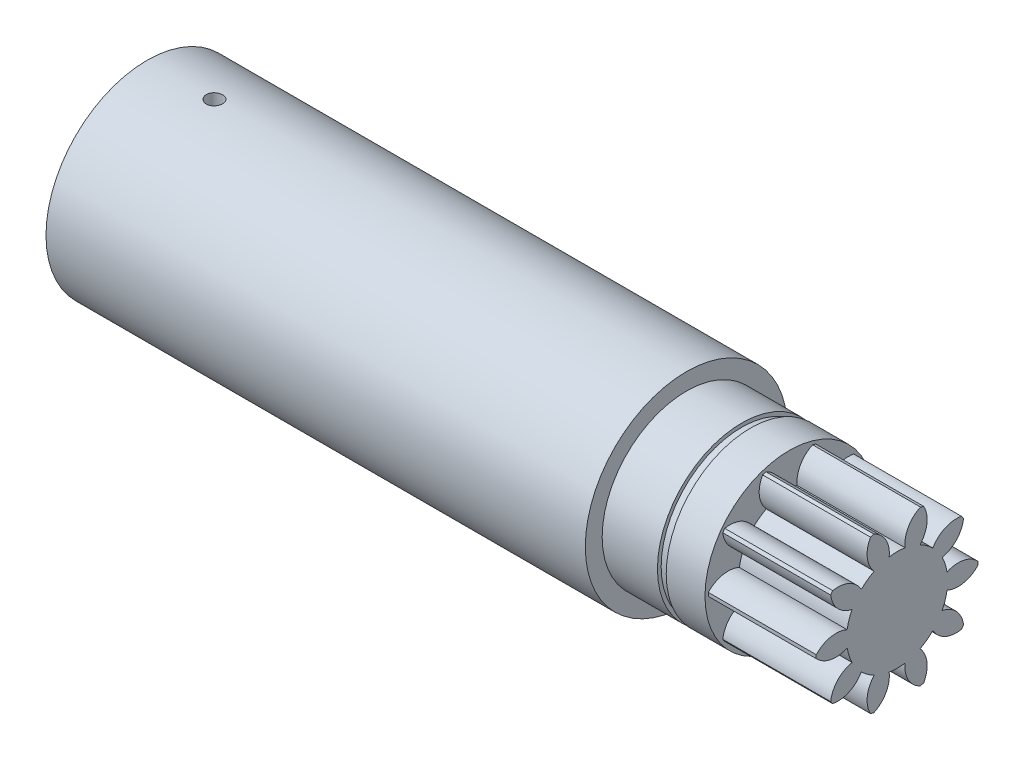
from build123d import *

# Parameters (mm, degrees)
BASPROSKE_W             = 16
BASPROSKE_H             = 12
TOOTHCUT_DEPTH          = 24.323807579
TEETHCUTS_COUNT         = 10
TEETHCUTS_ANGLE         = 324
BORSKE_R                = 7.4736
BORE_DEPTH              = 50.0000508
EXTRUSION2_START        = -16
ESQUISSE1_R             = 7.499
EXTRUSION2_DEPTH        = 16
ESQUISSE2_R             = 12.5
EXTRUSION3_DEPTH        = 5.75
ESQUISSE3_R             = 11.95
EXTRUSION4_DEPTH        = 1.3
ESQUISSE4_R             = 12.5
EXTRUSION5_DEPTH        = 8.2
ESQUISSE5_R             = 15
EXTRUSION6_DEPTH        = 80
D_GAGEMENT_M21_D        = 2.4
ENL_V_MAT_EXTRU_1_DEPTH = 20


with BuildPart() as part:
    # BasProSke → Base-Revolve (revolve)
    with BuildSketch(Plane(origin=(0, 0, 0), x_dir=(1, 0, 0), z_dir=(0, 1, 0)), mode=Mode.PRIVATE) as base_revolve_sk:
        with Locations((8, 6)):
            Rectangle(BASPROSKE_W, BASPROSKE_H)
    revolve(base_revolve_sk.sketch.rotate(Axis((-10, 0, 0), (1, 0, 0)), 180), axis=Axis((-10, 0, 0), (1, 0, 0)))

    # TooCutSke → ToothCut (cut, through all)
    with BuildSketch(Plane(origin=(0, 0, 0), x_dir=(0, 0, -1), z_dir=(1, 0, 0))):
        with BuildLine():
            ThreePointArc((1.173662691, 7.406586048), (0, 7.499), (-1.173662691, 7.406586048))
            ThreePointArc((-1.173662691, 7.406586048), (-1.668191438, 9.834565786), (-3.497907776, 11.50542856))
            ThreePointArc((-3.497907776, 11.50542856), (0, 12.0254), (3.497907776, 11.50542856))
            ThreePointArc((3.497907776, 11.50542856), (1.668191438, 9.834565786), (1.173662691, 7.406586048))
        make_face()
    toothcut = extrude(amount=TOOTHCUT_DEPTH, mode=Mode.SUBTRACT)

    # TeethCuts: ToothCut ×10 about axis
    teethcuts_axis = Axis((-10, 0, 0), (1, 0, 0))
    for i in range(1, TEETHCUTS_COUNT):
        add(toothcut.rotate(teethcuts_axis, i * TEETHCUTS_ANGLE / (TEETHCUTS_COUNT - 1)), mode=Mode.SUBTRACT)

    # BorSke → Bore (cut, symmetric)
    with BuildSketch(Plane(origin=(0, 0, 0), x_dir=(0, 0, -1), z_dir=(1, 0, 0))):
        with Locations(Location((0, 0, 0), (0, 0, 180))):
            Circle(BORSKE_R)
    extrude(amount=BORE_DEPTH, both=True, mode=Mode.SUBTRACT)

    # Esquisse1 → Extrusion2 (add)
    with BuildSketch(Plane(origin=(16, 0, 0), x_dir=(0, 0, -1), z_dir=(1, 0, 0)).offset(EXTRUSION2_START)):
        Circle(ESQUISSE1_R)
    extrude(amount=EXTRUSION2_DEPTH)

    # Esquisse2 → Extrusion3 (add)
    with BuildSketch(Plane.ZY):
        Circle(ESQUISSE2_R)
    extrude(amount=EXTRUSION3_DEPTH)

    # Esquisse3 → Extrusion4 (add)
    with BuildSketch(Plane.ZY.offset(5.75)):
        Circle(ESQUISSE3_R)
    extrude(amount=EXTRUSION4_DEPTH)

    # Esquisse4 → Extrusion5 (add)
    with BuildSketch(Plane.ZY.offset(7.05)):
        Circle(ESQUISSE4_R)
    extrude(amount=EXTRUSION5_DEPTH)

    # Esquisse5 → Extrusion6 (add)
    with BuildSketch(Plane.ZY.offset(15.25)):
        Circle(ESQUISSE5_R)
    extrude(amount=EXTRUSION6_DEPTH)

    # D_gagement M21 (through all)
    with Locations(Plane(origin=(0, 15, 0), x_dir=(-1, 0, 0), z_dir=(0, 1, 0))):
        with Locations((85.25, 0)):
            Hole(D_GAGEMENT_M21_D / 2)

    # Esquisse9 → Enl_v. mat.-Extru.1 (cut)
    with BuildSketch(Plane.ZY.offset(95.25)):
        with BuildLine():
            Line((-7, 7.141428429), (-7, -7.141428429))
            ThreePointArc((-7, -7.141428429), (0, -10), (7, -7.141428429))
            Line((7, -7.141428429), (7, 7.141428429))
            ThreePointArc((7, 7.141428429), (0, 10), (-7, 7.141428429))
        make_face()
    extrude(amount=-ENL_V_MAT_EXTRU_1_DEPTH, mode=Mode.SUBTRACT)


solid = part.part
